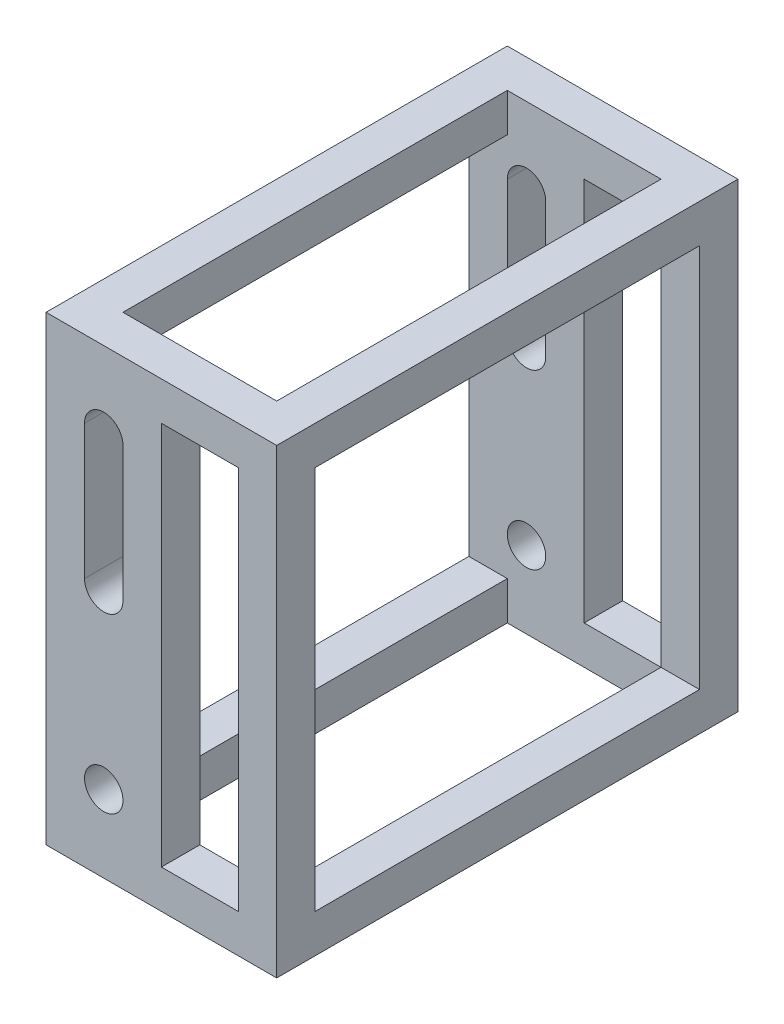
ISO-10303-21;
HEADER;
FILE_DESCRIPTION(('STEP AP214'),'2;1');
FILE_NAME('part.step','',(''),(''),'','','');
FILE_SCHEMA(('AUTOMOTIVE_DESIGN { 1 0 10303 214 1 1 1 1 }'));
ENDSEC;
DATA;
#1=APPLICATION_CONTEXT('core data for automotive mechanical design processes');
#2=APPLICATION_PROTOCOL_DEFINITION('international standard','automotive_design',2000,#1);
#3=PRODUCT_CONTEXT('',#1,'mechanical');
#4=PRODUCT('Part','Part','',(#3));
#5=PRODUCT_RELATED_PRODUCT_CATEGORY('part','',(#4));
#6=PRODUCT_DEFINITION_FORMATION('','',#4);
#7=PRODUCT_DEFINITION_CONTEXT('part definition',#1,'design');
#8=PRODUCT_DEFINITION('design','',#6,#7);
#9=PRODUCT_DEFINITION_SHAPE('','',#8);
#10=(LENGTH_UNIT() NAMED_UNIT(*) SI_UNIT(.MILLI.,.METRE.));
#11=(NAMED_UNIT(*) PLANE_ANGLE_UNIT() SI_UNIT($,.RADIAN.));
#12=(NAMED_UNIT(*) SI_UNIT($,.STERADIAN.) SOLID_ANGLE_UNIT());
#13=UNCERTAINTY_MEASURE_WITH_UNIT(LENGTH_MEASURE(1.E-05),#10,'distance_accuracy_value','');
#14=(GEOMETRIC_REPRESENTATION_CONTEXT(3) GLOBAL_UNCERTAINTY_ASSIGNED_CONTEXT((#13)) GLOBAL_UNIT_ASSIGNED_CONTEXT((#10,
#11,#12)) REPRESENTATION_CONTEXT('',''));
#15=CARTESIAN_POINT('',(0.,0.,0.));
#16=DIRECTION('',(0.,0.,1.));
#17=DIRECTION('',(1.,0.,0.));
#18=AXIS2_PLACEMENT_3D('',#15,#16,#17);
#19=CARTESIAN_POINT('',(12.7,0.,12.7));
#20=DIRECTION('',(0.,0.,-1.));
#21=DIRECTION('',(-1.,0.,0.));
#22=AXIS2_PLACEMENT_3D('',#19,#20,#21);
#23=PLANE('',#22);
#24=DIRECTION('',(0.,1.,0.));
#25=VECTOR('',#24,1.);
#26=CARTESIAN_POINT('',(12.7,0.,12.7));
#27=LINE('',#26,#25);
#28=CARTESIAN_POINT('',(12.7,82.55,12.7));
#29=VERTEX_POINT('',#28);
#30=CARTESIAN_POINT('',(12.7,127.,12.7));
#31=VERTEX_POINT('',#30);
#32=EDGE_CURVE('E293',#29,#31,#27,.T.);
#33=ORIENTED_EDGE('',*,*,#32,.T.);
#34=CARTESIAN_POINT('',(19.05,127.,12.7));
#35=DIRECTION('',(0.,0.,-1.));
#36=DIRECTION('',(-1.,0.,0.));
#37=AXIS2_PLACEMENT_3D('',#34,#35,#36);
#38=CIRCLE('',#37,6.35);
#39=CARTESIAN_POINT('',(25.4,127.,12.7));
#40=VERTEX_POINT('',#39);
#41=EDGE_CURVE('E342',#31,#40,#38,.T.);
#42=ORIENTED_EDGE('',*,*,#41,.T.);
#43=DIRECTION('',(0.,-1.,0.));
#44=VECTOR('',#43,1.);
#45=CARTESIAN_POINT('',(25.4,0.,12.7));
#46=LINE('',#45,#44);
#47=CARTESIAN_POINT('',(25.4,82.55,12.7));
#48=VERTEX_POINT('',#47);
#49=EDGE_CURVE('E339',#40,#48,#46,.T.);
#50=ORIENTED_EDGE('',*,*,#49,.T.);
#51=CARTESIAN_POINT('',(19.05,82.55,12.7));
#52=DIRECTION('',(0.,0.,-1.));
#53=DIRECTION('',(-1.,0.,0.));
#54=AXIS2_PLACEMENT_3D('',#51,#52,#53);
#55=CIRCLE('',#54,6.35);
#56=EDGE_CURVE('E336',#48,#29,#55,.T.);
#57=ORIENTED_EDGE('',*,*,#56,.T.);
#58=EDGE_LOOP('',(#33,#42,#50,#57));
#59=FACE_BOUND('',#58,.T.);
#60=CARTESIAN_POINT('',(19.05,25.4,12.7));
#61=DIRECTION('',(0.,0.,-1.));
#62=DIRECTION('',(-1.,0.,0.));
#63=AXIS2_PLACEMENT_3D('',#60,#61,#62);
#64=CIRCLE('',#63,6.35);
#65=CARTESIAN_POINT('',(25.4,25.4,12.7));
#66=VERTEX_POINT('',#65);
#67=EDGE_CURVE('E346',#66,#66,#64,.T.);
#68=ORIENTED_EDGE('',*,*,#67,.T.);
#69=EDGE_LOOP('',(#68));
#70=FACE_BOUND('',#69,.T.);
#71=DIRECTION('',(-1.,0.,0.));
#72=VECTOR('',#71,1.);
#73=CARTESIAN_POINT('',(12.7,12.7,12.7));
#74=LINE('',#73,#72);
#75=CARTESIAN_POINT('',(63.5,12.7,12.7));
#76=VERTEX_POINT('',#75);
#77=CARTESIAN_POINT('',(38.1,12.7,12.7));
#78=VERTEX_POINT('',#77);
#79=EDGE_CURVE('E283',#76,#78,#74,.T.);
#80=ORIENTED_EDGE('',*,*,#79,.T.);
#81=DIRECTION('',(0.,1.,0.));
#82=VECTOR('',#81,1.);
#83=CARTESIAN_POINT('',(38.1,0.,12.7));
#84=LINE('',#83,#82);
#85=CARTESIAN_POINT('',(38.1,139.7,12.7));
#86=VERTEX_POINT('',#85);
#87=EDGE_CURVE('E239',#78,#86,#84,.T.);
#88=ORIENTED_EDGE('',*,*,#87,.T.);
#89=DIRECTION('',(1.,0.,0.));
#90=VECTOR('',#89,1.);
#91=CARTESIAN_POINT('',(12.7,139.7,12.7));
#92=LINE('',#91,#90);
#93=CARTESIAN_POINT('',(63.5,139.7,12.7));
#94=VERTEX_POINT('',#93);
#95=EDGE_CURVE('E285',#86,#94,#92,.T.);
#96=ORIENTED_EDGE('',*,*,#95,.T.);
#97=DIRECTION('',(0.,1.,0.));
#98=VECTOR('',#97,1.);
#99=CARTESIAN_POINT('',(63.5,0.,12.7));
#100=LINE('',#99,#98);
#101=CARTESIAN_POINT('',(63.5,152.4,12.7));
#102=VERTEX_POINT('',#101);
#103=EDGE_CURVE('E431',#94,#102,#100,.T.);
#104=ORIENTED_EDGE('',*,*,#103,.T.);
#105=DIRECTION('',(-1.,0.,0.));
#106=VECTOR('',#105,1.);
#107=CARTESIAN_POINT('',(12.7,152.4,12.7));
#108=LINE('',#107,#106);
#109=CARTESIAN_POINT('',(12.7,152.4,12.7));
#110=VERTEX_POINT('',#109);
#111=EDGE_CURVE('E403',#102,#110,#108,.T.);
#112=ORIENTED_EDGE('',*,*,#111,.T.);
#113=DIRECTION('',(0.,1.,0.));
#114=VECTOR('',#113,1.);
#115=CARTESIAN_POINT('',(12.7,0.,12.7));
#116=LINE('',#115,#114);
#117=CARTESIAN_POINT('',(12.7,139.7,12.7));
#118=VERTEX_POINT('',#117);
#119=EDGE_CURVE('E427',#118,#110,#116,.T.);
#120=ORIENTED_EDGE('',*,*,#119,.F.);
#121=DIRECTION('',(1.,0.,0.));
#122=VECTOR('',#121,1.);
#123=CARTESIAN_POINT('',(0.,139.7,12.7));
#124=LINE('',#123,#122);
#125=CARTESIAN_POINT('',(0.,139.7,12.7));
#126=VERTEX_POINT('',#125);
#127=EDGE_CURVE('E378',#126,#118,#124,.T.);
#128=ORIENTED_EDGE('',*,*,#127,.F.);
#129=DIRECTION('',(0.,1.,0.));
#130=VECTOR('',#129,1.);
#131=CARTESIAN_POINT('',(0.,139.7,12.7));
#132=LINE('',#131,#130);
#133=CARTESIAN_POINT('',(0.,12.7,12.7));
#134=VERTEX_POINT('',#133);
#135=EDGE_CURVE('E357',#134,#126,#132,.T.);
#136=ORIENTED_EDGE('',*,*,#135,.F.);
#137=DIRECTION('',(1.,0.,0.));
#138=VECTOR('',#137,1.);
#139=CARTESIAN_POINT('',(0.,12.7,12.7));
#140=LINE('',#139,#138);
#141=CARTESIAN_POINT('',(12.7,12.7,12.7));
#142=VERTEX_POINT('',#141);
#143=EDGE_CURVE('E381',#134,#142,#140,.T.);
#144=ORIENTED_EDGE('',*,*,#143,.T.);
#145=CARTESIAN_POINT('',(12.7,0.,12.7));
#146=VERTEX_POINT('',#145);
#147=EDGE_CURVE('E423',#146,#142,#116,.T.);
#148=ORIENTED_EDGE('',*,*,#147,.F.);
#149=DIRECTION('',(-1.,0.,0.));
#150=VECTOR('',#149,1.);
#151=CARTESIAN_POINT('',(12.7,0.,12.7));
#152=LINE('',#151,#150);
#153=CARTESIAN_POINT('',(63.5,0.,12.7));
#154=VERTEX_POINT('',#153);
#155=EDGE_CURVE('E409',#154,#146,#152,.T.);
#156=ORIENTED_EDGE('',*,*,#155,.F.);
#157=EDGE_CURVE('E428',#154,#76,#100,.T.);
#158=ORIENTED_EDGE('',*,*,#157,.T.);
#159=EDGE_LOOP('',(#80,#88,#96,#104,#112,#120,#128,#136,#144,#148,#156,#158));
#160=FACE_BOUND('',#159,.T.);
#161=ADVANCED_FACE('F32',(#59,#70,#160),#23,.F.);
#162=CARTESIAN_POINT('',(12.7,0.,139.7));
#163=DIRECTION('',(0.,0.,1.));
#164=DIRECTION('',(1.,0.,0.));
#165=AXIS2_PLACEMENT_3D('',#162,#163,#164);
#166=PLANE('',#165);
#167=DIRECTION('',(0.,1.,0.));
#168=VECTOR('',#167,1.);
#169=CARTESIAN_POINT('',(25.4,0.,139.7));
#170=LINE('',#169,#168);
#171=CARTESIAN_POINT('',(25.4,82.55,139.7));
#172=VERTEX_POINT('',#171);
#173=CARTESIAN_POINT('',(25.4,127.,139.7));
#174=VERTEX_POINT('',#173);
#175=EDGE_CURVE('E474',#172,#174,#170,.T.);
#176=ORIENTED_EDGE('',*,*,#175,.T.);
#177=CARTESIAN_POINT('',(19.05,127.,139.7));
#178=DIRECTION('',(0.,0.,1.));
#179=DIRECTION('',(1.,0.,0.));
#180=AXIS2_PLACEMENT_3D('',#177,#178,#179);
#181=CIRCLE('',#180,6.35);
#182=CARTESIAN_POINT('',(12.7,127.,139.7));
#183=VERTEX_POINT('',#182);
#184=EDGE_CURVE('E477',#174,#183,#181,.T.);
#185=ORIENTED_EDGE('',*,*,#184,.T.);
#186=DIRECTION('',(0.,-1.,0.));
#187=VECTOR('',#186,1.);
#188=CARTESIAN_POINT('',(12.7,0.,139.7));
#189=LINE('',#188,#187);
#190=CARTESIAN_POINT('',(12.7,82.55,139.7));
#191=VERTEX_POINT('',#190);
#192=EDGE_CURVE('E468',#183,#191,#189,.T.);
#193=ORIENTED_EDGE('',*,*,#192,.T.);
#194=CARTESIAN_POINT('',(19.05,82.55,139.7));
#195=DIRECTION('',(0.,0.,1.));
#196=DIRECTION('',(1.,0.,0.));
#197=AXIS2_PLACEMENT_3D('',#194,#195,#196);
#198=CIRCLE('',#197,6.35);
#199=EDGE_CURVE('E471',#191,#172,#198,.T.);
#200=ORIENTED_EDGE('',*,*,#199,.T.);
#201=EDGE_LOOP('',(#176,#185,#193,#200));
#202=FACE_BOUND('',#201,.T.);
#203=CARTESIAN_POINT('',(19.05,25.4,139.7));
#204=DIRECTION('',(0.,0.,1.));
#205=DIRECTION('',(1.,0.,0.));
#206=AXIS2_PLACEMENT_3D('',#203,#204,#205);
#207=CIRCLE('',#206,6.35);
#208=CARTESIAN_POINT('',(25.4,25.4,139.7));
#209=VERTEX_POINT('',#208);
#210=EDGE_CURVE('E345',#209,#209,#207,.T.);
#211=ORIENTED_EDGE('',*,*,#210,.T.);
#212=EDGE_LOOP('',(#211));
#213=FACE_BOUND('',#212,.T.);
#214=DIRECTION('',(-1.,0.,0.));
#215=VECTOR('',#214,1.);
#216=CARTESIAN_POINT('',(12.7,139.7,139.7));
#217=LINE('',#216,#215);
#218=CARTESIAN_POINT('',(63.5,139.7,139.7));
#219=VERTEX_POINT('',#218);
#220=CARTESIAN_POINT('',(38.1,139.7,139.7));
#221=VERTEX_POINT('',#220);
#222=EDGE_CURVE('E40',#219,#221,#217,.T.);
#223=ORIENTED_EDGE('',*,*,#222,.T.);
#224=DIRECTION('',(0.,-1.,0.));
#225=VECTOR('',#224,1.);
#226=CARTESIAN_POINT('',(38.1,0.,139.7));
#227=LINE('',#226,#225);
#228=CARTESIAN_POINT('',(38.1,12.7,139.7));
#229=VERTEX_POINT('',#228);
#230=EDGE_CURVE('E11',#221,#229,#227,.T.);
#231=ORIENTED_EDGE('',*,*,#230,.T.);
#232=DIRECTION('',(1.,0.,0.));
#233=VECTOR('',#232,1.);
#234=CARTESIAN_POINT('',(12.7,12.7,139.7));
#235=LINE('',#234,#233);
#236=CARTESIAN_POINT('',(63.5,12.7,139.7));
#237=VERTEX_POINT('',#236);
#238=EDGE_CURVE('E480',#229,#237,#235,.T.);
#239=ORIENTED_EDGE('',*,*,#238,.T.);
#240=DIRECTION('',(0.,1.,0.));
#241=VECTOR('',#240,1.);
#242=CARTESIAN_POINT('',(63.5,0.,139.7));
#243=LINE('',#242,#241);
#244=CARTESIAN_POINT('',(63.5,0.,139.7));
#245=VERTEX_POINT('',#244);
#246=EDGE_CURVE('E432',#245,#237,#243,.T.);
#247=ORIENTED_EDGE('',*,*,#246,.F.);
#248=DIRECTION('',(1.,0.,0.));
#249=VECTOR('',#248,1.);
#250=CARTESIAN_POINT('',(12.7,0.,139.7));
#251=LINE('',#250,#249);
#252=CARTESIAN_POINT('',(12.7,0.,139.7));
#253=VERTEX_POINT('',#252);
#254=EDGE_CURVE('E402',#253,#245,#251,.T.);
#255=ORIENTED_EDGE('',*,*,#254,.F.);
#256=DIRECTION('',(0.,1.,0.));
#257=VECTOR('',#256,1.);
#258=CARTESIAN_POINT('',(12.7,0.,139.7));
#259=LINE('',#258,#257);
#260=CARTESIAN_POINT('',(12.7,12.7,139.7));
#261=VERTEX_POINT('',#260);
#262=EDGE_CURVE('E436',#253,#261,#259,.T.);
#263=ORIENTED_EDGE('',*,*,#262,.T.);
#264=DIRECTION('',(1.,0.,0.));
#265=VECTOR('',#264,1.);
#266=CARTESIAN_POINT('',(0.,12.7,139.7));
#267=LINE('',#266,#265);
#268=CARTESIAN_POINT('',(0.,12.7,139.7));
#269=VERTEX_POINT('',#268);
#270=EDGE_CURVE('E385',#269,#261,#267,.T.);
#271=ORIENTED_EDGE('',*,*,#270,.F.);
#272=DIRECTION('',(0.,-1.,0.));
#273=VECTOR('',#272,1.);
#274=CARTESIAN_POINT('',(0.,139.7,139.7));
#275=LINE('',#274,#273);
#276=CARTESIAN_POINT('',(0.,139.7,139.7));
#277=VERTEX_POINT('',#276);
#278=EDGE_CURVE('E350',#277,#269,#275,.T.);
#279=ORIENTED_EDGE('',*,*,#278,.F.);
#280=DIRECTION('',(1.,0.,0.));
#281=VECTOR('',#280,1.);
#282=CARTESIAN_POINT('',(0.,139.7,139.7));
#283=LINE('',#282,#281);
#284=CARTESIAN_POINT('',(12.7,139.7,139.7));
#285=VERTEX_POINT('',#284);
#286=EDGE_CURVE('E373',#277,#285,#283,.T.);
#287=ORIENTED_EDGE('',*,*,#286,.T.);
#288=CARTESIAN_POINT('',(12.7,152.4,139.7));
#289=VERTEX_POINT('',#288);
#290=EDGE_CURVE('E412',#285,#289,#259,.T.);
#291=ORIENTED_EDGE('',*,*,#290,.T.);
#292=DIRECTION('',(1.,0.,0.));
#293=VECTOR('',#292,1.);
#294=CARTESIAN_POINT('',(12.7,152.4,139.7));
#295=LINE('',#294,#293);
#296=CARTESIAN_POINT('',(63.5,152.4,139.7));
#297=VERTEX_POINT('',#296);
#298=EDGE_CURVE('E415',#289,#297,#295,.T.);
#299=ORIENTED_EDGE('',*,*,#298,.T.);
#300=EDGE_CURVE('E435',#219,#297,#243,.T.);
#301=ORIENTED_EDGE('',*,*,#300,.F.);
#302=EDGE_LOOP('',(#223,#231,#239,#247,#255,#263,#271,#279,#287,#291,#299,#301));
#303=FACE_BOUND('',#302,.T.);
#304=ADVANCED_FACE('F487',(#202,#213,#303),#166,.F.);
#305=CARTESIAN_POINT('',(12.7,0.,12.7));
#306=DIRECTION('',(-1.,0.,0.));
#307=DIRECTION('',(0.,0.,1.));
#308=AXIS2_PLACEMENT_3D('',#305,#306,#307);
#309=PLANE('',#308);
#310=ORIENTED_EDGE('',*,*,#290,.F.);
#311=DIRECTION('',(0.,0.,-1.));
#312=VECTOR('',#311,1.);
#313=CARTESIAN_POINT('',(12.7,139.7,12.7));
#314=LINE('',#313,#312);
#315=EDGE_CURVE('E395',#285,#118,#314,.T.);
#316=ORIENTED_EDGE('',*,*,#315,.T.);
#317=ORIENTED_EDGE('',*,*,#119,.T.);
#318=DIRECTION('',(0.,0.,1.));
#319=VECTOR('',#318,1.);
#320=CARTESIAN_POINT('',(12.7,152.4,12.7));
#321=LINE('',#320,#319);
#322=EDGE_CURVE('E398',#110,#289,#321,.T.);
#323=ORIENTED_EDGE('',*,*,#322,.T.);
#324=EDGE_LOOP('',(#310,#316,#317,#323));
#325=FACE_BOUND('',#324,.T.);
#326=ADVANCED_FACE('F575',(#325),#309,.F.);
#327=CARTESIAN_POINT('',(63.5,0.,12.7));
#328=DIRECTION('',(1.,0.,0.));
#329=DIRECTION('',(0.,0.,-1.));
#330=AXIS2_PLACEMENT_3D('',#327,#328,#329);
#331=PLANE('',#330);
#332=ORIENTED_EDGE('',*,*,#103,.F.);
#333=DIRECTION('',(0.,0.,1.));
#334=VECTOR('',#333,1.);
#335=CARTESIAN_POINT('',(63.5,139.7,12.7));
#336=LINE('',#335,#334);
#337=EDGE_CURVE('E392',#94,#219,#336,.T.);
#338=ORIENTED_EDGE('',*,*,#337,.T.);
#339=ORIENTED_EDGE('',*,*,#300,.T.);
#340=DIRECTION('',(0.,0.,-1.));
#341=VECTOR('',#340,1.);
#342=CARTESIAN_POINT('',(63.5,152.4,12.7));
#343=LINE('',#342,#341);
#344=EDGE_CURVE('E418',#297,#102,#343,.T.);
#345=ORIENTED_EDGE('',*,*,#344,.T.);
#346=EDGE_LOOP('',(#332,#338,#339,#345));
#347=FACE_BOUND('',#346,.T.);
#348=ADVANCED_FACE('F510',(#347),#331,.F.);
#349=CARTESIAN_POINT('',(0.,0.,152.4));
#350=DIRECTION('',(1.,0.,0.));
#351=DIRECTION('',(0.,0.,-1.));
#352=AXIS2_PLACEMENT_3D('',#349,#350,#351);
#353=PLANE('',#352);
#354=DIRECTION('',(0.,0.,1.));
#355=VECTOR('',#354,1.);
#356=CARTESIAN_POINT('',(0.,139.7,139.7));
#357=LINE('',#356,#355);
#358=EDGE_CURVE('E360',#126,#277,#357,.T.);
#359=ORIENTED_EDGE('',*,*,#358,.T.);
#360=ORIENTED_EDGE('',*,*,#278,.T.);
#361=DIRECTION('',(0.,0.,-1.));
#362=VECTOR('',#361,1.);
#363=CARTESIAN_POINT('',(0.,12.7,139.7));
#364=LINE('',#363,#362);
#365=EDGE_CURVE('E353',#269,#134,#364,.T.);
#366=ORIENTED_EDGE('',*,*,#365,.T.);
#367=ORIENTED_EDGE('',*,*,#135,.T.);
#368=EDGE_LOOP('',(#359,#360,#366,#367));
#369=FACE_BOUND('',#368,.T.);
#370=DIRECTION('',(0.,-1.,0.));
#371=VECTOR('',#370,1.);
#372=CARTESIAN_POINT('',(0.,0.,0.));
#373=LINE('',#372,#371);
#374=CARTESIAN_POINT('',(0.,152.4,0.));
#375=VERTEX_POINT('',#374);
#376=CARTESIAN_POINT('',(0.,0.,0.));
#377=VERTEX_POINT('',#376);
#378=EDGE_CURVE('E426',#375,#377,#373,.T.);
#379=ORIENTED_EDGE('',*,*,#378,.T.);
#380=DIRECTION('',(0.,0.,-1.));
#381=VECTOR('',#380,1.);
#382=CARTESIAN_POINT('',(0.,0.,152.4));
#383=LINE('',#382,#381);
#384=CARTESIAN_POINT('',(0.,0.,152.4));
#385=VERTEX_POINT('',#384);
#386=EDGE_CURVE('E465',#385,#377,#383,.T.);
#387=ORIENTED_EDGE('',*,*,#386,.F.);
#388=DIRECTION('',(0.,-1.,0.));
#389=VECTOR('',#388,1.);
#390=CARTESIAN_POINT('',(0.,0.,152.4));
#391=LINE('',#390,#389);
#392=CARTESIAN_POINT('',(0.,152.4,152.4));
#393=VERTEX_POINT('',#392);
#394=EDGE_CURVE('E439',#393,#385,#391,.T.);
#395=ORIENTED_EDGE('',*,*,#394,.F.);
#396=DIRECTION('',(0.,0.,-1.));
#397=VECTOR('',#396,1.);
#398=CARTESIAN_POINT('',(0.,152.4,152.4));
#399=LINE('',#398,#397);
#400=EDGE_CURVE('E449',#393,#375,#399,.T.);
#401=ORIENTED_EDGE('',*,*,#400,.T.);
#402=EDGE_LOOP('',(#379,#387,#395,#401));
#403=FACE_BOUND('',#402,.T.);
#404=ADVANCED_FACE('F34',(#369,#403),#353,.F.);
#405=CARTESIAN_POINT('',(0.,0.,152.4));
#406=DIRECTION('',(0.,1.,0.));
#407=DIRECTION('',(0.,0.,1.));
#408=AXIS2_PLACEMENT_3D('',#405,#406,#407);
#409=PLANE('',#408);
#410=ORIENTED_EDGE('',*,*,#155,.T.);
#411=DIRECTION('',(0.,0.,1.));
#412=VECTOR('',#411,1.);
#413=CARTESIAN_POINT('',(12.7,0.,12.7));
#414=LINE('',#413,#412);
#415=EDGE_CURVE('E399',#146,#253,#414,.T.);
#416=ORIENTED_EDGE('',*,*,#415,.T.);
#417=ORIENTED_EDGE('',*,*,#254,.T.);
#418=DIRECTION('',(0.,0.,-1.));
#419=VECTOR('',#418,1.);
#420=CARTESIAN_POINT('',(63.5,0.,12.7));
#421=LINE('',#420,#419);
#422=EDGE_CURVE('E406',#245,#154,#421,.T.);
#423=ORIENTED_EDGE('',*,*,#422,.T.);
#424=EDGE_LOOP('',(#410,#416,#417,#423));
#425=FACE_BOUND('',#424,.T.);
#426=DIRECTION('',(1.,0.,0.));
#427=VECTOR('',#426,1.);
#428=CARTESIAN_POINT('',(0.,0.,0.));
#429=LINE('',#428,#427);
#430=CARTESIAN_POINT('',(76.2,0.,0.));
#431=VERTEX_POINT('',#430);
#432=EDGE_CURVE('E452',#377,#431,#429,.T.);
#433=ORIENTED_EDGE('',*,*,#432,.T.);
#434=DIRECTION('',(0.,0.,-1.));
#435=VECTOR('',#434,1.);
#436=CARTESIAN_POINT('',(76.2,0.,152.4));
#437=LINE('',#436,#435);
#438=CARTESIAN_POINT('',(76.2,0.,152.4));
#439=VERTEX_POINT('',#438);
#440=EDGE_CURVE('E462',#439,#431,#437,.T.);
#441=ORIENTED_EDGE('',*,*,#440,.F.);
#442=DIRECTION('',(1.,0.,0.));
#443=VECTOR('',#442,1.);
#444=CARTESIAN_POINT('',(0.,0.,152.4));
#445=LINE('',#444,#443);
#446=EDGE_CURVE('E442',#385,#439,#445,.T.);
#447=ORIENTED_EDGE('',*,*,#446,.F.);
#448=ORIENTED_EDGE('',*,*,#386,.T.);
#449=EDGE_LOOP('',(#433,#441,#447,#448));
#450=FACE_BOUND('',#449,.T.);
#451=ADVANCED_FACE('F533',(#425,#450),#409,.F.);
#452=CARTESIAN_POINT('',(76.2,0.,152.4));
#453=DIRECTION('',(-1.,0.,0.));
#454=DIRECTION('',(0.,0.,1.));
#455=AXIS2_PLACEMENT_3D('',#452,#453,#454);
#456=PLANE('',#455);
#457=DIRECTION('',(0.,0.,-1.));
#458=VECTOR('',#457,1.);
#459=CARTESIAN_POINT('',(76.2,12.7,139.7));
#460=LINE('',#459,#458);
#461=CARTESIAN_POINT('',(76.2,12.7,139.7));
#462=VERTEX_POINT('',#461);
#463=CARTESIAN_POINT('',(76.2,12.7,12.7));
#464=VERTEX_POINT('',#463);
#465=EDGE_CURVE('E365',#462,#464,#460,.T.);
#466=ORIENTED_EDGE('',*,*,#465,.F.);
#467=DIRECTION('',(0.,-1.,0.));
#468=VECTOR('',#467,1.);
#469=CARTESIAN_POINT('',(76.2,139.7,139.7));
#470=LINE('',#469,#468);
#471=CARTESIAN_POINT('',(76.2,139.7,139.7));
#472=VERTEX_POINT('',#471);
#473=EDGE_CURVE('E349',#472,#462,#470,.T.);
#474=ORIENTED_EDGE('',*,*,#473,.F.);
#475=DIRECTION('',(0.,0.,1.));
#476=VECTOR('',#475,1.);
#477=CARTESIAN_POINT('',(76.2,139.7,139.7));
#478=LINE('',#477,#476);
#479=CARTESIAN_POINT('',(76.2,139.7,12.7));
#480=VERTEX_POINT('',#479);
#481=EDGE_CURVE('E354',#480,#472,#478,.T.);
#482=ORIENTED_EDGE('',*,*,#481,.F.);
#483=DIRECTION('',(0.,1.,0.));
#484=VECTOR('',#483,1.);
#485=CARTESIAN_POINT('',(76.2,139.7,12.7));
#486=LINE('',#485,#484);
#487=EDGE_CURVE('E368',#464,#480,#486,.T.);
#488=ORIENTED_EDGE('',*,*,#487,.F.);
#489=EDGE_LOOP('',(#466,#474,#482,#488));
#490=FACE_BOUND('',#489,.T.);
#491=DIRECTION('',(0.,1.,0.));
#492=VECTOR('',#491,1.);
#493=CARTESIAN_POINT('',(76.2,0.,0.));
#494=LINE('',#493,#492);
#495=CARTESIAN_POINT('',(76.2,152.4,0.));
#496=VERTEX_POINT('',#495);
#497=EDGE_CURVE('E454',#431,#496,#494,.T.);
#498=ORIENTED_EDGE('',*,*,#497,.T.);
#499=DIRECTION('',(0.,0.,-1.));
#500=VECTOR('',#499,1.);
#501=CARTESIAN_POINT('',(76.2,152.4,152.4));
#502=LINE('',#501,#500);
#503=CARTESIAN_POINT('',(76.2,152.4,152.4));
#504=VERTEX_POINT('',#503);
#505=EDGE_CURVE('E459',#504,#496,#502,.T.);
#506=ORIENTED_EDGE('',*,*,#505,.F.);
#507=DIRECTION('',(0.,1.,0.));
#508=VECTOR('',#507,1.);
#509=CARTESIAN_POINT('',(76.2,0.,152.4));
#510=LINE('',#509,#508);
#511=EDGE_CURVE('E445',#439,#504,#510,.T.);
#512=ORIENTED_EDGE('',*,*,#511,.F.);
#513=ORIENTED_EDGE('',*,*,#440,.T.);
#514=EDGE_LOOP('',(#498,#506,#512,#513));
#515=FACE_BOUND('',#514,.T.);
#516=ADVANCED_FACE('F563',(#490,#515),#456,.F.);
#517=CARTESIAN_POINT('',(0.,152.4,152.4));
#518=DIRECTION('',(0.,-1.,0.));
#519=DIRECTION('',(0.,0.,-1.));
#520=AXIS2_PLACEMENT_3D('',#517,#518,#519);
#521=PLANE('',#520);
#522=ORIENTED_EDGE('',*,*,#298,.F.);
#523=ORIENTED_EDGE('',*,*,#322,.F.);
#524=ORIENTED_EDGE('',*,*,#111,.F.);
#525=ORIENTED_EDGE('',*,*,#344,.F.);
#526=EDGE_LOOP('',(#522,#523,#524,#525));
#527=FACE_BOUND('',#526,.T.);
#528=DIRECTION('',(-1.,0.,0.));
#529=VECTOR('',#528,1.);
#530=CARTESIAN_POINT('',(0.,152.4,0.));
#531=LINE('',#530,#529);
#532=EDGE_CURVE('E443',#496,#375,#531,.T.);
#533=ORIENTED_EDGE('',*,*,#532,.T.);
#534=ORIENTED_EDGE('',*,*,#400,.F.);
#535=DIRECTION('',(-1.,0.,0.));
#536=VECTOR('',#535,1.);
#537=CARTESIAN_POINT('',(0.,152.4,152.4));
#538=LINE('',#537,#536);
#539=EDGE_CURVE('E447',#504,#393,#538,.T.);
#540=ORIENTED_EDGE('',*,*,#539,.F.);
#541=ORIENTED_EDGE('',*,*,#505,.T.);
#542=EDGE_LOOP('',(#533,#534,#540,#541));
#543=FACE_BOUND('',#542,.T.);
#544=ADVANCED_FACE('F544',(#527,#543),#521,.F.);
#545=CARTESIAN_POINT('',(0.,0.,152.4));
#546=DIRECTION('',(0.,0.,-1.));
#547=DIRECTION('',(-1.,0.,0.));
#548=AXIS2_PLACEMENT_3D('',#545,#546,#547);
#549=PLANE('',#548);
#550=DIRECTION('',(1.,0.,0.));
#551=VECTOR('',#550,1.);
#552=CARTESIAN_POINT('',(38.1,12.7,152.4));
#553=LINE('',#552,#551);
#554=CARTESIAN_POINT('',(38.1,12.7,152.4));
#555=VERTEX_POINT('',#554);
#556=CARTESIAN_POINT('',(63.5,12.7,152.4));
#557=VERTEX_POINT('',#556);
#558=EDGE_CURVE('E264',#555,#557,#553,.T.);
#559=ORIENTED_EDGE('',*,*,#558,.F.);
#560=DIRECTION('',(0.,-1.,0.));
#561=VECTOR('',#560,1.);
#562=CARTESIAN_POINT('',(38.1,139.7,152.4));
#563=LINE('',#562,#561);
#564=CARTESIAN_POINT('',(38.1,139.7,152.4));
#565=VERTEX_POINT('',#564);
#566=EDGE_CURVE('E47',#565,#555,#563,.T.);
#567=ORIENTED_EDGE('',*,*,#566,.F.);
#568=DIRECTION('',(-1.,0.,0.));
#569=VECTOR('',#568,1.);
#570=CARTESIAN_POINT('',(38.1,139.7,152.4));
#571=LINE('',#570,#569);
#572=CARTESIAN_POINT('',(63.5,139.7,152.4));
#573=VERTEX_POINT('',#572);
#574=EDGE_CURVE('E255',#573,#565,#571,.T.);
#575=ORIENTED_EDGE('',*,*,#574,.F.);
#576=DIRECTION('',(0.,1.,0.));
#577=VECTOR('',#576,1.);
#578=CARTESIAN_POINT('',(63.5,139.7,152.4));
#579=LINE('',#578,#577);
#580=EDGE_CURVE('E258',#557,#573,#579,.T.);
#581=ORIENTED_EDGE('',*,*,#580,.F.);
#582=EDGE_LOOP('',(#559,#567,#575,#581));
#583=FACE_BOUND('',#582,.T.);
#584=CARTESIAN_POINT('',(19.05,25.4,152.4));
#585=DIRECTION('',(0.,0.,1.));
#586=DIRECTION('',(1.,0.,0.));
#587=AXIS2_PLACEMENT_3D('',#584,#585,#586);
#588=CIRCLE('',#587,6.35);
#589=CARTESIAN_POINT('',(25.4,25.4,152.4));
#590=VERTEX_POINT('',#589);
#591=EDGE_CURVE('E294',#590,#590,#588,.T.);
#592=ORIENTED_EDGE('',*,*,#591,.F.);
#593=EDGE_LOOP('',(#592));
#594=FACE_BOUND('',#593,.T.);
#595=DIRECTION('',(0.,-1.,0.));
#596=VECTOR('',#595,1.);
#597=CARTESIAN_POINT('',(12.7,127.,152.4));
#598=LINE('',#597,#596);
#599=CARTESIAN_POINT('',(12.7,127.,152.4));
#600=VERTEX_POINT('',#599);
#601=CARTESIAN_POINT('',(12.7,82.55,152.4));
#602=VERTEX_POINT('',#601);
#603=EDGE_CURVE('E313',#600,#602,#598,.T.);
#604=ORIENTED_EDGE('',*,*,#603,.F.);
#605=CARTESIAN_POINT('',(19.05,127.,152.4));
#606=DIRECTION('',(0.,0.,1.));
#607=DIRECTION('',(1.,0.,0.));
#608=AXIS2_PLACEMENT_3D('',#605,#606,#607);
#609=CIRCLE('',#608,6.35);
#610=CARTESIAN_POINT('',(25.4,127.,152.4));
#611=VERTEX_POINT('',#610);
#612=EDGE_CURVE('E289',#611,#600,#609,.T.);
#613=ORIENTED_EDGE('',*,*,#612,.F.);
#614=DIRECTION('',(0.,1.,0.));
#615=VECTOR('',#614,1.);
#616=CARTESIAN_POINT('',(25.4,127.,152.4));
#617=LINE('',#616,#615);
#618=CARTESIAN_POINT('',(25.4,82.55,152.4));
#619=VERTEX_POINT('',#618);
#620=EDGE_CURVE('E302',#619,#611,#617,.T.);
#621=ORIENTED_EDGE('',*,*,#620,.F.);
#622=CARTESIAN_POINT('',(19.05,82.55,152.4));
#623=DIRECTION('',(0.,0.,1.));
#624=DIRECTION('',(1.,0.,0.));
#625=AXIS2_PLACEMENT_3D('',#622,#623,#624);
#626=CIRCLE('',#625,6.35);
#627=EDGE_CURVE('E316',#602,#619,#626,.T.);
#628=ORIENTED_EDGE('',*,*,#627,.F.);
#629=EDGE_LOOP('',(#604,#613,#621,#628));
#630=FACE_BOUND('',#629,.T.);
#631=ORIENTED_EDGE('',*,*,#394,.T.);
#632=ORIENTED_EDGE('',*,*,#446,.T.);
#633=ORIENTED_EDGE('',*,*,#511,.T.);
#634=ORIENTED_EDGE('',*,*,#539,.T.);
#635=EDGE_LOOP('',(#631,#632,#633,#634));
#636=FACE_BOUND('',#635,.T.);
#637=ADVANCED_FACE('F541',(#583,#594,#630,#636),#549,.F.);
#638=CARTESIAN_POINT('',(0.,0.,0.));
#639=DIRECTION('',(0.,0.,-1.));
#640=DIRECTION('',(-1.,0.,0.));
#641=AXIS2_PLACEMENT_3D('',#638,#639,#640);
#642=PLANE('',#641);
#643=DIRECTION('',(0.,-1.,0.));
#644=VECTOR('',#643,1.);
#645=CARTESIAN_POINT('',(38.1,139.7,0.));
#646=LINE('',#645,#644);
#647=CARTESIAN_POINT('',(38.1,139.7,0.));
#648=VERTEX_POINT('',#647);
#649=CARTESIAN_POINT('',(38.1,12.7,0.));
#650=VERTEX_POINT('',#649);
#651=EDGE_CURVE('E236',#648,#650,#646,.T.);
#652=ORIENTED_EDGE('',*,*,#651,.T.);
#653=DIRECTION('',(1.,0.,0.));
#654=VECTOR('',#653,1.);
#655=CARTESIAN_POINT('',(38.1,12.7,0.));
#656=LINE('',#655,#654);
#657=CARTESIAN_POINT('',(63.5,12.7,0.));
#658=VERTEX_POINT('',#657);
#659=EDGE_CURVE('E246',#650,#658,#656,.T.);
#660=ORIENTED_EDGE('',*,*,#659,.T.);
#661=DIRECTION('',(0.,1.,0.));
#662=VECTOR('',#661,1.);
#663=CARTESIAN_POINT('',(63.5,139.7,0.));
#664=LINE('',#663,#662);
#665=CARTESIAN_POINT('',(63.5,139.7,0.));
#666=VERTEX_POINT('',#665);
#667=EDGE_CURVE('E55',#658,#666,#664,.T.);
#668=ORIENTED_EDGE('',*,*,#667,.T.);
#669=DIRECTION('',(-1.,0.,0.));
#670=VECTOR('',#669,1.);
#671=CARTESIAN_POINT('',(38.1,139.7,0.));
#672=LINE('',#671,#670);
#673=EDGE_CURVE('E254',#666,#648,#672,.T.);
#674=ORIENTED_EDGE('',*,*,#673,.T.);
#675=EDGE_LOOP('',(#652,#660,#668,#674));
#676=FACE_BOUND('',#675,.T.);
#677=CARTESIAN_POINT('',(19.05,25.4,0.));
#678=DIRECTION('',(0.,0.,1.));
#679=DIRECTION('',(1.,0.,0.));
#680=AXIS2_PLACEMENT_3D('',#677,#678,#679);
#681=CIRCLE('',#680,6.35);
#682=CARTESIAN_POINT('',(25.4,25.4,0.));
#683=VERTEX_POINT('',#682);
#684=EDGE_CURVE('E290',#683,#683,#681,.T.);
#685=ORIENTED_EDGE('',*,*,#684,.T.);
#686=EDGE_LOOP('',(#685));
#687=FACE_BOUND('',#686,.T.);
#688=CARTESIAN_POINT('',(19.05,127.,0.));
#689=DIRECTION('',(0.,0.,1.));
#690=DIRECTION('',(1.,0.,0.));
#691=AXIS2_PLACEMENT_3D('',#688,#689,#690);
#692=CIRCLE('',#691,6.35);
#693=CARTESIAN_POINT('',(25.4,127.,0.));
#694=VERTEX_POINT('',#693);
#695=CARTESIAN_POINT('',(12.7,127.,0.));
#696=VERTEX_POINT('',#695);
#697=EDGE_CURVE('E298',#694,#696,#692,.T.);
#698=ORIENTED_EDGE('',*,*,#697,.T.);
#699=DIRECTION('',(0.,-1.,0.));
#700=VECTOR('',#699,1.);
#701=CARTESIAN_POINT('',(12.7,127.,0.));
#702=LINE('',#701,#700);
#703=CARTESIAN_POINT('',(12.7,82.55,0.));
#704=VERTEX_POINT('',#703);
#705=EDGE_CURVE('E301',#696,#704,#702,.T.);
#706=ORIENTED_EDGE('',*,*,#705,.T.);
#707=CARTESIAN_POINT('',(19.05,82.55,0.));
#708=DIRECTION('',(0.,0.,1.));
#709=DIRECTION('',(1.,0.,0.));
#710=AXIS2_PLACEMENT_3D('',#707,#708,#709);
#711=CIRCLE('',#710,6.35);
#712=CARTESIAN_POINT('',(25.4,82.55,0.));
#713=VERTEX_POINT('',#712);
#714=EDGE_CURVE('E305',#704,#713,#711,.T.);
#715=ORIENTED_EDGE('',*,*,#714,.T.);
#716=DIRECTION('',(0.,1.,0.));
#717=VECTOR('',#716,1.);
#718=CARTESIAN_POINT('',(25.4,127.,0.));
#719=LINE('',#718,#717);
#720=EDGE_CURVE('E308',#713,#694,#719,.T.);
#721=ORIENTED_EDGE('',*,*,#720,.T.);
#722=EDGE_LOOP('',(#698,#706,#715,#721));
#723=FACE_BOUND('',#722,.T.);
#724=ORIENTED_EDGE('',*,*,#378,.F.);
#725=ORIENTED_EDGE('',*,*,#532,.F.);
#726=ORIENTED_EDGE('',*,*,#497,.F.);
#727=ORIENTED_EDGE('',*,*,#432,.F.);
#728=EDGE_LOOP('',(#724,#725,#726,#727));
#729=FACE_BOUND('',#728,.T.);
#730=ADVANCED_FACE('F251',(#676,#687,#723,#729),#642,.T.);
#731=ORIENTED_EDGE('',*,*,#147,.T.);
#732=DIRECTION('',(0.,0.,1.));
#733=VECTOR('',#732,1.);
#734=CARTESIAN_POINT('',(12.7,12.7,12.7));
#735=LINE('',#734,#733);
#736=EDGE_CURVE('E389',#142,#261,#735,.T.);
#737=ORIENTED_EDGE('',*,*,#736,.T.);
#738=ORIENTED_EDGE('',*,*,#262,.F.);
#739=ORIENTED_EDGE('',*,*,#415,.F.);
#740=EDGE_LOOP('',(#731,#737,#738,#739));
#741=FACE_BOUND('',#740,.T.);
#742=ADVANCED_FACE('F568',(#741),#309,.F.);
#743=EDGE_CURVE('E380',#94,#480,#124,.T.);
#744=ORIENTED_EDGE('',*,*,#743,.F.);
#745=DIRECTION('',(0.,-1.,0.));
#746=VECTOR('',#745,1.);
#747=CARTESIAN_POINT('',(63.5,0.,12.7));
#748=LINE('',#747,#746);
#749=EDGE_CURVE('E280',#94,#76,#748,.T.);
#750=ORIENTED_EDGE('',*,*,#749,.T.);
#751=EDGE_CURVE('E384',#76,#464,#140,.T.);
#752=ORIENTED_EDGE('',*,*,#751,.T.);
#753=ORIENTED_EDGE('',*,*,#487,.T.);
#754=EDGE_LOOP('',(#744,#750,#752,#753));
#755=FACE_BOUND('',#754,.T.);
#756=ADVANCED_FACE('F521',(#755),#23,.F.);
#757=ORIENTED_EDGE('',*,*,#246,.T.);
#758=DIRECTION('',(0.,0.,-1.));
#759=VECTOR('',#758,1.);
#760=CARTESIAN_POINT('',(63.5,12.7,12.7));
#761=LINE('',#760,#759);
#762=EDGE_CURVE('E376',#237,#76,#761,.T.);
#763=ORIENTED_EDGE('',*,*,#762,.T.);
#764=ORIENTED_EDGE('',*,*,#157,.F.);
#765=ORIENTED_EDGE('',*,*,#422,.F.);
#766=EDGE_LOOP('',(#757,#763,#764,#765));
#767=FACE_BOUND('',#766,.T.);
#768=ADVANCED_FACE('F528',(#767),#331,.F.);
#769=EDGE_CURVE('E363',#237,#462,#267,.T.);
#770=ORIENTED_EDGE('',*,*,#769,.F.);
#771=DIRECTION('',(0.,1.,0.));
#772=VECTOR('',#771,1.);
#773=CARTESIAN_POINT('',(63.5,0.,139.7));
#774=LINE('',#773,#772);
#775=EDGE_CURVE('E271',#237,#219,#774,.T.);
#776=ORIENTED_EDGE('',*,*,#775,.T.);
#777=EDGE_CURVE('E377',#219,#472,#283,.T.);
#778=ORIENTED_EDGE('',*,*,#777,.T.);
#779=ORIENTED_EDGE('',*,*,#473,.T.);
#780=EDGE_LOOP('',(#770,#776,#778,#779));
#781=FACE_BOUND('',#780,.T.);
#782=ADVANCED_FACE('F500',(#781),#166,.F.);
#783=CARTESIAN_POINT('',(0.,12.7,139.7));
#784=DIRECTION('',(0.,-1.,0.));
#785=DIRECTION('',(0.,0.,-1.));
#786=AXIS2_PLACEMENT_3D('',#783,#784,#785);
#787=PLANE('',#786);
#788=ORIENTED_EDGE('',*,*,#769,.T.);
#789=ORIENTED_EDGE('',*,*,#465,.T.);
#790=ORIENTED_EDGE('',*,*,#751,.F.);
#791=ORIENTED_EDGE('',*,*,#762,.F.);
#792=EDGE_LOOP('',(#788,#789,#790,#791));
#793=FACE_BOUND('',#792,.T.);
#794=ADVANCED_FACE('F524',(#793),#787,.F.);
#795=CARTESIAN_POINT('',(0.,139.7,139.7));
#796=DIRECTION('',(0.,1.,0.));
#797=DIRECTION('',(0.,0.,1.));
#798=AXIS2_PLACEMENT_3D('',#795,#796,#797);
#799=PLANE('',#798);
#800=ORIENTED_EDGE('',*,*,#743,.T.);
#801=ORIENTED_EDGE('',*,*,#481,.T.);
#802=ORIENTED_EDGE('',*,*,#777,.F.);
#803=ORIENTED_EDGE('',*,*,#337,.F.);
#804=EDGE_LOOP('',(#800,#801,#802,#803));
#805=FACE_BOUND('',#804,.T.);
#806=ADVANCED_FACE('F504',(#805),#799,.F.);
#807=ORIENTED_EDGE('',*,*,#286,.F.);
#808=ORIENTED_EDGE('',*,*,#358,.F.);
#809=ORIENTED_EDGE('',*,*,#127,.T.);
#810=ORIENTED_EDGE('',*,*,#315,.F.);
#811=EDGE_LOOP('',(#807,#808,#809,#810));
#812=FACE_BOUND('',#811,.T.);
#813=ADVANCED_FACE('F609',(#812),#799,.F.);
#814=ORIENTED_EDGE('',*,*,#143,.F.);
#815=ORIENTED_EDGE('',*,*,#365,.F.);
#816=ORIENTED_EDGE('',*,*,#270,.T.);
#817=ORIENTED_EDGE('',*,*,#736,.F.);
#818=EDGE_LOOP('',(#814,#815,#816,#817));
#819=FACE_BOUND('',#818,.T.);
#820=ADVANCED_FACE('F613',(#819),#787,.F.);
#821=CARTESIAN_POINT('',(12.7,127.,0.));
#822=DIRECTION('',(-1.,0.,0.));
#823=DIRECTION('',(0.,0.,1.));
#824=AXIS2_PLACEMENT_3D('',#821,#822,#823);
#825=PLANE('',#824);
#826=DIRECTION('',(0.,0.,1.));
#827=VECTOR('',#826,1.);
#828=CARTESIAN_POINT('',(12.7,127.,0.));
#829=LINE('',#828,#827);
#830=EDGE_CURVE('E311',#183,#600,#829,.T.);
#831=ORIENTED_EDGE('',*,*,#830,.T.);
#832=ORIENTED_EDGE('',*,*,#603,.T.);
#833=DIRECTION('',(0.,0.,1.));
#834=VECTOR('',#833,1.);
#835=CARTESIAN_POINT('',(12.7,82.55,0.));
#836=LINE('',#835,#834);
#837=EDGE_CURVE('E331',#191,#602,#836,.T.);
#838=ORIENTED_EDGE('',*,*,#837,.F.);
#839=ORIENTED_EDGE('',*,*,#192,.F.);
#840=EDGE_LOOP('',(#831,#832,#838,#839));
#841=FACE_BOUND('',#840,.T.);
#842=ADVANCED_FACE('F615',(#841),#825,.F.);
#843=CARTESIAN_POINT('',(19.05,82.55,0.));
#844=DIRECTION('',(0.,0.,1.));
#845=DIRECTION('',(1.,0.,0.));
#846=AXIS2_PLACEMENT_3D('',#843,#844,#845);
#847=CYLINDRICAL_SURFACE('',#846,6.35);
#848=ORIENTED_EDGE('',*,*,#837,.T.);
#849=ORIENTED_EDGE('',*,*,#627,.T.);
#850=DIRECTION('',(0.,0.,1.));
#851=VECTOR('',#850,1.);
#852=CARTESIAN_POINT('',(25.4,82.55,0.));
#853=LINE('',#852,#851);
#854=EDGE_CURVE('E327',#172,#619,#853,.T.);
#855=ORIENTED_EDGE('',*,*,#854,.F.);
#856=ORIENTED_EDGE('',*,*,#199,.F.);
#857=EDGE_LOOP('',(#848,#849,#855,#856));
#858=FACE_BOUND('',#857,.T.);
#859=ADVANCED_FACE('F620',(#858),#847,.F.);
#860=CARTESIAN_POINT('',(25.4,127.,0.));
#861=DIRECTION('',(1.,0.,0.));
#862=DIRECTION('',(0.,0.,-1.));
#863=AXIS2_PLACEMENT_3D('',#860,#861,#862);
#864=PLANE('',#863);
#865=ORIENTED_EDGE('',*,*,#854,.T.);
#866=ORIENTED_EDGE('',*,*,#620,.T.);
#867=DIRECTION('',(0.,0.,1.));
#868=VECTOR('',#867,1.);
#869=CARTESIAN_POINT('',(25.4,127.,0.));
#870=LINE('',#869,#868);
#871=EDGE_CURVE('E323',#174,#611,#870,.T.);
#872=ORIENTED_EDGE('',*,*,#871,.F.);
#873=ORIENTED_EDGE('',*,*,#175,.F.);
#874=EDGE_LOOP('',(#865,#866,#872,#873));
#875=FACE_BOUND('',#874,.T.);
#876=ADVANCED_FACE('F649',(#875),#864,.F.);
#877=CARTESIAN_POINT('',(19.05,127.,0.));
#878=DIRECTION('',(0.,0.,1.));
#879=DIRECTION('',(1.,0.,0.));
#880=AXIS2_PLACEMENT_3D('',#877,#878,#879);
#881=CYLINDRICAL_SURFACE('',#880,6.35);
#882=ORIENTED_EDGE('',*,*,#871,.T.);
#883=ORIENTED_EDGE('',*,*,#612,.T.);
#884=ORIENTED_EDGE('',*,*,#830,.F.);
#885=ORIENTED_EDGE('',*,*,#184,.F.);
#886=EDGE_LOOP('',(#882,#883,#884,#885));
#887=FACE_BOUND('',#886,.T.);
#888=ADVANCED_FACE('F637',(#887),#881,.F.);
#889=CARTESIAN_POINT('',(19.05,25.4,0.));
#890=DIRECTION('',(0.,0.,1.));
#891=DIRECTION('',(1.,0.,0.));
#892=AXIS2_PLACEMENT_3D('',#889,#890,#891);
#893=CYLINDRICAL_SURFACE('',#892,6.35);
#894=CARTESIAN_POINT('',(25.4,25.4,152.4));
#895=CARTESIAN_POINT('',(25.4,25.4,152.267708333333));
#896=CARTESIAN_POINT('',(25.4,25.4,152.135416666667));
#897=CARTESIAN_POINT('',(25.4,25.4,151.870833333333));
#898=CARTESIAN_POINT('',(25.4,25.4,151.738541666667));
#899=CARTESIAN_POINT('',(25.4,25.4,151.473958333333));
#900=CARTESIAN_POINT('',(25.4,25.4,151.341666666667));
#901=CARTESIAN_POINT('',(25.4,25.4,151.077083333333));
#902=CARTESIAN_POINT('',(25.4,25.4,150.944791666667));
#903=CARTESIAN_POINT('',(25.4,25.4,150.680208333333));
#904=CARTESIAN_POINT('',(25.4,25.4,150.547916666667));
#905=CARTESIAN_POINT('',(25.4,25.4,150.283333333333));
#906=CARTESIAN_POINT('',(25.4,25.4,150.151041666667));
#907=CARTESIAN_POINT('',(25.4,25.4,149.886458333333));
#908=CARTESIAN_POINT('',(25.4,25.4,149.754166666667));
#909=CARTESIAN_POINT('',(25.4,25.4,149.489583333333));
#910=CARTESIAN_POINT('',(25.4,25.4,149.357291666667));
#911=CARTESIAN_POINT('',(25.4,25.4,149.092708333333));
#912=CARTESIAN_POINT('',(25.4,25.4,148.960416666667));
#913=CARTESIAN_POINT('',(25.4,25.4,148.695833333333));
#914=CARTESIAN_POINT('',(25.4,25.4,148.563541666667));
#915=CARTESIAN_POINT('',(25.4,25.4,148.298958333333));
#916=CARTESIAN_POINT('',(25.4,25.4,148.166666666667));
#917=CARTESIAN_POINT('',(25.4,25.4,147.902083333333));
#918=CARTESIAN_POINT('',(25.4,25.4,147.769791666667));
#919=CARTESIAN_POINT('',(25.4,25.4,147.505208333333));
#920=CARTESIAN_POINT('',(25.4,25.4,147.372916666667));
#921=CARTESIAN_POINT('',(25.4,25.4,147.108333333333));
#922=CARTESIAN_POINT('',(25.4,25.4,146.976041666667));
#923=CARTESIAN_POINT('',(25.4,25.4,146.711458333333));
#924=CARTESIAN_POINT('',(25.4,25.4,146.579166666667));
#925=CARTESIAN_POINT('',(25.4,25.4,146.314583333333));
#926=CARTESIAN_POINT('',(25.4,25.4,146.182291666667));
#927=CARTESIAN_POINT('',(25.4,25.4,145.917708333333));
#928=CARTESIAN_POINT('',(25.4,25.4,145.785416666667));
#929=CARTESIAN_POINT('',(25.4,25.4,145.520833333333));
#930=CARTESIAN_POINT('',(25.4,25.4,145.388541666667));
#931=CARTESIAN_POINT('',(25.4,25.4,145.123958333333));
#932=CARTESIAN_POINT('',(25.4,25.4,144.991666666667));
#933=CARTESIAN_POINT('',(25.4,25.4,144.727083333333));
#934=CARTESIAN_POINT('',(25.4,25.4,144.594791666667));
#935=CARTESIAN_POINT('',(25.4,25.4,144.330208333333));
#936=CARTESIAN_POINT('',(25.4,25.4,144.197916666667));
#937=CARTESIAN_POINT('',(25.4,25.4,143.933333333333));
#938=CARTESIAN_POINT('',(25.4,25.4,143.801041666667));
#939=CARTESIAN_POINT('',(25.4,25.4,143.536458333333));
#940=CARTESIAN_POINT('',(25.4,25.4,143.404166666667));
#941=CARTESIAN_POINT('',(25.4,25.4,143.139583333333));
#942=CARTESIAN_POINT('',(25.4,25.4,143.007291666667));
#943=CARTESIAN_POINT('',(25.4,25.4,142.742708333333));
#944=CARTESIAN_POINT('',(25.4,25.4,142.610416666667));
#945=CARTESIAN_POINT('',(25.4,25.4,142.345833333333));
#946=CARTESIAN_POINT('',(25.4,25.4,142.213541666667));
#947=CARTESIAN_POINT('',(25.4,25.4,141.948958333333));
#948=CARTESIAN_POINT('',(25.4,25.4,141.816666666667));
#949=CARTESIAN_POINT('',(25.4,25.4,141.552083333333));
#950=CARTESIAN_POINT('',(25.4,25.4,141.419791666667));
#951=CARTESIAN_POINT('',(25.4,25.4,141.155208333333));
#952=CARTESIAN_POINT('',(25.4,25.4,141.022916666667));
#953=CARTESIAN_POINT('',(25.4,25.4,140.758333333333));
#954=CARTESIAN_POINT('',(25.4,25.4,140.626041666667));
#955=CARTESIAN_POINT('',(25.4,25.4,140.361458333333));
#956=CARTESIAN_POINT('',(25.4,25.4,140.229166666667));
#957=CARTESIAN_POINT('',(25.4,25.4,139.964583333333));
#958=CARTESIAN_POINT('',(25.4,25.4,139.832291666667));
#959=CARTESIAN_POINT('',(25.4,25.4,139.7));
#960=B_SPLINE_CURVE_WITH_KNOTS('',3,(#894,#895,#896,#897,#898,#899,#900,#901,#902,#903,#904,
#905,#906,#907,#908,#909,#910,#911,#912,#913,#914,#915,#916,#917,#918,#919,#920,#921,#922,#923,
#924,#925,#926,#927,#928,#929,#930,#931,#932,#933,#934,#935,#936,#937,#938,#939,#940,#941,#942,
#943,#944,#945,#946,#947,#948,#949,#950,#951,#952,#953,#954,#955,#956,#957,#958,#959),
.UNSPECIFIED.,.F.,.F.,(4,2,2,2,2,2,2,2,2,2,2,2,2,2,2,2,2,2,2,2,2,2,2,2,2,2,2,2,2,2,2,2,4),(0.,
0.396874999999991,0.79375000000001,1.190625,1.58750000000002,1.98437500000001,2.38125,
2.77812500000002,3.17500000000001,3.571875,3.96875000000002,4.36562500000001,4.7625,
5.15937500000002,5.55625000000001,5.95312500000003,6.35000000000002,6.74687500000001,
7.14375000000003,7.54062500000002,7.93750000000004,8.33437500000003,8.73125000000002,
9.12812500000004,9.52500000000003,9.92187500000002,10.31875,10.715625,11.1125,11.509375,
11.90625,12.3031250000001,12.7),.UNSPECIFIED.);
#961=EDGE_CURVE('BSEAM635',#590,#209,#960,.T.);
#962=ORIENTED_EDGE('',*,*,#591,.T.);
#963=ORIENTED_EDGE('',*,*,#210,.F.);
#964=ORIENTED_EDGE('',*,*,#961,.T.);
#965=ORIENTED_EDGE('',*,*,#961,.F.);
#966=EDGE_LOOP('',(#962,#964,#963,#965));
#967=FACE_BOUND('',#966,.T.);
#968=ADVANCED_FACE('F635',(#967),#893,.F.);
#969=EDGE_CURVE('E332',#696,#31,#829,.T.);
#970=ORIENTED_EDGE('',*,*,#969,.F.);
#971=ORIENTED_EDGE('',*,*,#697,.F.);
#972=EDGE_CURVE('E297',#694,#40,#870,.T.);
#973=ORIENTED_EDGE('',*,*,#972,.T.);
#974=ORIENTED_EDGE('',*,*,#41,.F.);
#975=EDGE_LOOP('',(#970,#971,#973,#974));
#976=FACE_BOUND('',#975,.T.);
#977=ADVANCED_FACE('F632',(#976),#881,.F.);
#978=ORIENTED_EDGE('',*,*,#972,.F.);
#979=ORIENTED_EDGE('',*,*,#720,.F.);
#980=EDGE_CURVE('E324',#713,#48,#853,.T.);
#981=ORIENTED_EDGE('',*,*,#980,.T.);
#982=ORIENTED_EDGE('',*,*,#49,.F.);
#983=EDGE_LOOP('',(#978,#979,#981,#982));
#984=FACE_BOUND('',#983,.T.);
#985=ADVANCED_FACE('F634',(#984),#864,.F.);
#986=ORIENTED_EDGE('',*,*,#980,.F.);
#987=ORIENTED_EDGE('',*,*,#714,.F.);
#988=EDGE_CURVE('E328',#704,#29,#836,.T.);
#989=ORIENTED_EDGE('',*,*,#988,.T.);
#990=ORIENTED_EDGE('',*,*,#56,.F.);
#991=EDGE_LOOP('',(#986,#987,#989,#990));
#992=FACE_BOUND('',#991,.T.);
#993=ADVANCED_FACE('F641',(#992),#847,.F.);
#994=ORIENTED_EDGE('',*,*,#988,.F.);
#995=ORIENTED_EDGE('',*,*,#705,.F.);
#996=ORIENTED_EDGE('',*,*,#969,.T.);
#997=ORIENTED_EDGE('',*,*,#32,.F.);
#998=EDGE_LOOP('',(#994,#995,#996,#997));
#999=FACE_BOUND('',#998,.T.);
#1000=ADVANCED_FACE('F623',(#999),#825,.F.);
#1001=CARTESIAN_POINT('',(25.4,25.4,0.));
#1002=CARTESIAN_POINT('',(25.4,25.4,0.132291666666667));
#1003=CARTESIAN_POINT('',(25.4,25.4,0.264583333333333));
#1004=CARTESIAN_POINT('',(25.4,25.4,0.529166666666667));
#1005=CARTESIAN_POINT('',(25.4,25.4,0.661458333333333));
#1006=CARTESIAN_POINT('',(25.4,25.4,0.926041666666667));
#1007=CARTESIAN_POINT('',(25.4,25.4,1.05833333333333));
#1008=CARTESIAN_POINT('',(25.4,25.4,1.32291666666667));
#1009=CARTESIAN_POINT('',(25.4,25.4,1.45520833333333));
#1010=CARTESIAN_POINT('',(25.4,25.4,1.71979166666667));
#1011=CARTESIAN_POINT('',(25.4,25.4,1.85208333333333));
#1012=CARTESIAN_POINT('',(25.4,25.4,2.11666666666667));
#1013=CARTESIAN_POINT('',(25.4,25.4,2.24895833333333));
#1014=CARTESIAN_POINT('',(25.4,25.4,2.51354166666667));
#1015=CARTESIAN_POINT('',(25.4,25.4,2.64583333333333));
#1016=CARTESIAN_POINT('',(25.4,25.4,2.91041666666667));
#1017=CARTESIAN_POINT('',(25.4,25.4,3.04270833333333));
#1018=CARTESIAN_POINT('',(25.4,25.4,3.30729166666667));
#1019=CARTESIAN_POINT('',(25.4,25.4,3.43958333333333));
#1020=CARTESIAN_POINT('',(25.4,25.4,3.70416666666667));
#1021=CARTESIAN_POINT('',(25.4,25.4,3.83645833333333));
#1022=CARTESIAN_POINT('',(25.4,25.4,4.10104166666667));
#1023=CARTESIAN_POINT('',(25.4,25.4,4.23333333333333));
#1024=CARTESIAN_POINT('',(25.4,25.4,4.49791666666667));
#1025=CARTESIAN_POINT('',(25.4,25.4,4.63020833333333));
#1026=CARTESIAN_POINT('',(25.4,25.4,4.89479166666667));
#1027=CARTESIAN_POINT('',(25.4,25.4,5.02708333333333));
#1028=CARTESIAN_POINT('',(25.4,25.4,5.29166666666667));
#1029=CARTESIAN_POINT('',(25.4,25.4,5.42395833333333));
#1030=CARTESIAN_POINT('',(25.4,25.4,5.68854166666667));
#1031=CARTESIAN_POINT('',(25.4,25.4,5.82083333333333));
#1032=CARTESIAN_POINT('',(25.4,25.4,6.08541666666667));
#1033=CARTESIAN_POINT('',(25.4,25.4,6.21770833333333));
#1034=CARTESIAN_POINT('',(25.4,25.4,6.48229166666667));
#1035=CARTESIAN_POINT('',(25.4,25.4,6.61458333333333));
#1036=CARTESIAN_POINT('',(25.4,25.4,6.87916666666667));
#1037=CARTESIAN_POINT('',(25.4,25.4,7.01145833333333));
#1038=CARTESIAN_POINT('',(25.4,25.4,7.27604166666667));
#1039=CARTESIAN_POINT('',(25.4,25.4,7.40833333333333));
#1040=CARTESIAN_POINT('',(25.4,25.4,7.67291666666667));
#1041=CARTESIAN_POINT('',(25.4,25.4,7.80520833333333));
#1042=CARTESIAN_POINT('',(25.4,25.4,8.06979166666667));
#1043=CARTESIAN_POINT('',(25.4,25.4,8.20208333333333));
#1044=CARTESIAN_POINT('',(25.4,25.4,8.46666666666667));
#1045=CARTESIAN_POINT('',(25.4,25.4,8.59895833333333));
#1046=CARTESIAN_POINT('',(25.4,25.4,8.86354166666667));
#1047=CARTESIAN_POINT('',(25.4,25.4,8.99583333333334));
#1048=CARTESIAN_POINT('',(25.4,25.4,9.26041666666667));
#1049=CARTESIAN_POINT('',(25.4,25.4,9.39270833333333));
#1050=CARTESIAN_POINT('',(25.4,25.4,9.65729166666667));
#1051=CARTESIAN_POINT('',(25.4,25.4,9.78958333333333));
#1052=CARTESIAN_POINT('',(25.4,25.4,10.0541666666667));
#1053=CARTESIAN_POINT('',(25.4,25.4,10.1864583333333));
#1054=CARTESIAN_POINT('',(25.4,25.4,10.4510416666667));
#1055=CARTESIAN_POINT('',(25.4,25.4,10.5833333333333));
#1056=CARTESIAN_POINT('',(25.4,25.4,10.8479166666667));
#1057=CARTESIAN_POINT('',(25.4,25.4,10.9802083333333));
#1058=CARTESIAN_POINT('',(25.4,25.4,11.2447916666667));
#1059=CARTESIAN_POINT('',(25.4,25.4,11.3770833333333));
#1060=CARTESIAN_POINT('',(25.4,25.4,11.6416666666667));
#1061=CARTESIAN_POINT('',(25.4,25.4,11.7739583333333));
#1062=CARTESIAN_POINT('',(25.4,25.4,12.0385416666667));
#1063=CARTESIAN_POINT('',(25.4,25.4,12.1708333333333));
#1064=CARTESIAN_POINT('',(25.4,25.4,12.4354166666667));
#1065=CARTESIAN_POINT('',(25.4,25.4,12.5677083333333));
#1066=CARTESIAN_POINT('',(25.4,25.4,12.7));
#1067=B_SPLINE_CURVE_WITH_KNOTS('',3,(#1001,#1002,#1003,#1004,#1005,#1006,#1007,#1008,#1009,
#1010,#1011,#1012,#1013,#1014,#1015,#1016,#1017,#1018,#1019,#1020,#1021,#1022,#1023,#1024,#1025,
#1026,#1027,#1028,#1029,#1030,#1031,#1032,#1033,#1034,#1035,#1036,#1037,#1038,#1039,#1040,#1041,
#1042,#1043,#1044,#1045,#1046,#1047,#1048,#1049,#1050,#1051,#1052,#1053,#1054,#1055,#1056,#1057,
#1058,#1059,#1060,#1061,#1062,#1063,#1064,#1065,#1066),.UNSPECIFIED.,.F.,.F.,(4,2,2,2,2,2,2,2,2,
2,2,2,2,2,2,2,2,2,2,2,2,2,2,2,2,2,2,2,2,2,2,2,4),(0.,0.396875,0.79375,1.190625,1.5875,1.984375,
2.38125,2.778125,3.175,3.571875,3.96875,4.365625,4.7625,5.159375,5.55625,5.953125,6.35,6.746875,
7.14375,7.540625,7.9375,8.334375,8.73125,9.128125,9.525,9.921875,10.31875,10.715625,11.1125,
11.509375,11.90625,12.303125,12.7),.UNSPECIFIED.);
#1068=EDGE_CURVE('BSEAM640',#683,#66,#1067,.T.);
#1069=ORIENTED_EDGE('',*,*,#684,.F.);
#1070=ORIENTED_EDGE('',*,*,#67,.F.);
#1071=ORIENTED_EDGE('',*,*,#1068,.T.);
#1072=ORIENTED_EDGE('',*,*,#1068,.F.);
#1073=EDGE_LOOP('',(#1069,#1071,#1070,#1072));
#1074=FACE_BOUND('',#1073,.T.);
#1075=ADVANCED_FACE('F640',(#1074),#893,.F.);
#1076=CARTESIAN_POINT('',(38.1,12.7,0.));
#1077=DIRECTION('',(0.,-1.,0.));
#1078=DIRECTION('',(0.,0.,-1.));
#1079=AXIS2_PLACEMENT_3D('',#1076,#1077,#1078);
#1080=PLANE('',#1079);
#1081=DIRECTION('',(0.,0.,1.));
#1082=VECTOR('',#1081,1.);
#1083=CARTESIAN_POINT('',(38.1,12.7,0.));
#1084=LINE('',#1083,#1082);
#1085=EDGE_CURVE('E243',#229,#555,#1084,.T.);
#1086=ORIENTED_EDGE('',*,*,#1085,.T.);
#1087=ORIENTED_EDGE('',*,*,#558,.T.);
#1088=DIRECTION('',(0.,0.,1.));
#1089=VECTOR('',#1088,1.);
#1090=CARTESIAN_POINT('',(63.5,12.7,0.));
#1091=LINE('',#1090,#1089);
#1092=EDGE_CURVE('E242',#237,#557,#1091,.T.);
#1093=ORIENTED_EDGE('',*,*,#1092,.F.);
#1094=ORIENTED_EDGE('',*,*,#238,.F.);
#1095=EDGE_LOOP('',(#1086,#1087,#1093,#1094));
#1096=FACE_BOUND('',#1095,.T.);
#1097=ADVANCED_FACE('F537',(#1096),#1080,.F.);
#1098=CARTESIAN_POINT('',(63.5,139.7,0.));
#1099=DIRECTION('',(1.,0.,0.));
#1100=DIRECTION('',(0.,1.,0.));
#1101=AXIS2_PLACEMENT_3D('',#1098,#1099,#1100);
#1102=PLANE('',#1101);
#1103=ORIENTED_EDGE('',*,*,#1092,.T.);
#1104=ORIENTED_EDGE('',*,*,#580,.T.);
#1105=DIRECTION('',(0.,0.,1.));
#1106=VECTOR('',#1105,1.);
#1107=CARTESIAN_POINT('',(63.5,139.7,0.));
#1108=LINE('',#1107,#1106);
#1109=EDGE_CURVE('E276',#219,#573,#1108,.T.);
#1110=ORIENTED_EDGE('',*,*,#1109,.F.);
#1111=ORIENTED_EDGE('',*,*,#775,.F.);
#1112=EDGE_LOOP('',(#1103,#1104,#1110,#1111));
#1113=FACE_BOUND('',#1112,.T.);
#1114=ADVANCED_FACE('F494',(#1113),#1102,.F.);
#1115=CARTESIAN_POINT('',(38.1,139.7,0.));
#1116=DIRECTION('',(0.,1.,0.));
#1117=DIRECTION('',(0.,0.,1.));
#1118=AXIS2_PLACEMENT_3D('',#1115,#1116,#1117);
#1119=PLANE('',#1118);
#1120=ORIENTED_EDGE('',*,*,#1109,.T.);
#1121=ORIENTED_EDGE('',*,*,#574,.T.);
#1122=DIRECTION('',(0.,0.,1.));
#1123=VECTOR('',#1122,1.);
#1124=CARTESIAN_POINT('',(38.1,139.7,0.));
#1125=LINE('',#1124,#1123);
#1126=EDGE_CURVE('E272',#221,#565,#1125,.T.);
#1127=ORIENTED_EDGE('',*,*,#1126,.F.);
#1128=ORIENTED_EDGE('',*,*,#222,.F.);
#1129=EDGE_LOOP('',(#1120,#1121,#1127,#1128));
#1130=FACE_BOUND('',#1129,.T.);
#1131=ADVANCED_FACE('F491',(#1130),#1119,.F.);
#1132=CARTESIAN_POINT('',(38.1,139.7,0.));
#1133=DIRECTION('',(-1.,0.,0.));
#1134=DIRECTION('',(0.,-1.,0.));
#1135=AXIS2_PLACEMENT_3D('',#1132,#1133,#1134);
#1136=PLANE('',#1135);
#1137=ORIENTED_EDGE('',*,*,#1126,.T.);
#1138=ORIENTED_EDGE('',*,*,#566,.T.);
#1139=ORIENTED_EDGE('',*,*,#1085,.F.);
#1140=ORIENTED_EDGE('',*,*,#230,.F.);
#1141=EDGE_LOOP('',(#1137,#1138,#1139,#1140));
#1142=FACE_BOUND('',#1141,.T.);
#1143=ADVANCED_FACE('F539',(#1142),#1136,.F.);
#1144=EDGE_CURVE('E231',#650,#78,#1084,.T.);
#1145=ORIENTED_EDGE('',*,*,#1144,.F.);
#1146=ORIENTED_EDGE('',*,*,#651,.F.);
#1147=EDGE_CURVE('E269',#648,#86,#1125,.T.);
#1148=ORIENTED_EDGE('',*,*,#1147,.T.);
#1149=ORIENTED_EDGE('',*,*,#87,.F.);
#1150=EDGE_LOOP('',(#1145,#1146,#1148,#1149));
#1151=FACE_BOUND('',#1150,.T.);
#1152=ADVANCED_FACE('F233',(#1151),#1136,.F.);
#1153=ORIENTED_EDGE('',*,*,#1147,.F.);
#1154=ORIENTED_EDGE('',*,*,#673,.F.);
#1155=EDGE_CURVE('E273',#666,#94,#1108,.T.);
#1156=ORIENTED_EDGE('',*,*,#1155,.T.);
#1157=ORIENTED_EDGE('',*,*,#95,.F.);
#1158=EDGE_LOOP('',(#1153,#1154,#1156,#1157));
#1159=FACE_BOUND('',#1158,.T.);
#1160=ADVANCED_FACE('F517',(#1159),#1119,.F.);
#1161=EDGE_CURVE('E248',#658,#76,#1091,.T.);
#1162=ORIENTED_EDGE('',*,*,#1161,.F.);
#1163=ORIENTED_EDGE('',*,*,#659,.F.);
#1164=ORIENTED_EDGE('',*,*,#1144,.T.);
#1165=ORIENTED_EDGE('',*,*,#79,.F.);
#1166=EDGE_LOOP('',(#1162,#1163,#1164,#1165));
#1167=FACE_BOUND('',#1166,.T.);
#1168=ADVANCED_FACE('F247',(#1167),#1080,.F.);
#1169=ORIENTED_EDGE('',*,*,#1155,.F.);
#1170=ORIENTED_EDGE('',*,*,#667,.F.);
#1171=ORIENTED_EDGE('',*,*,#1161,.T.);
#1172=ORIENTED_EDGE('',*,*,#749,.F.);
#1173=EDGE_LOOP('',(#1169,#1170,#1171,#1172));
#1174=FACE_BOUND('',#1173,.T.);
#1175=ADVANCED_FACE('F518',(#1174),#1102,.F.);
#1176=CLOSED_SHELL('',(#161,#304,#326,#348,#404,#451,#516,#544,#637,#730,#742,#756,#768,#782,
#794,#806,#813,#820,#842,#859,#876,#888,#968,#977,#985,#993,#1000,#1075,#1097,#1114,#1131,#1143,
#1152,#1160,#1168,#1175));
#1177=MANIFOLD_SOLID_BREP('B2',#1176);
#1178=ADVANCED_BREP_SHAPE_REPRESENTATION('',(#18,#1177),#14);
#1179=SHAPE_DEFINITION_REPRESENTATION(#9,#1178);
ENDSEC;
END-ISO-10303-21;
